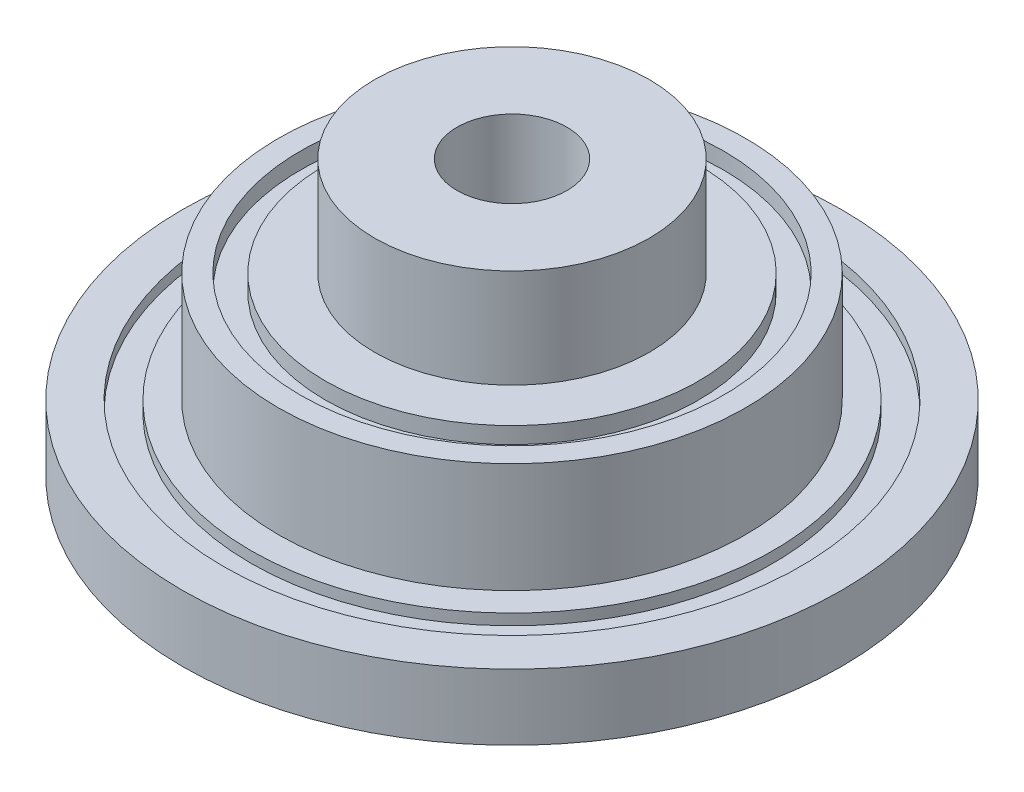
from build123d import *

# Parameters (mm, degrees)
SKETCH1_R          = 60
EXTRUDE1_DEPTH     = 12
SKETCH2_R          = 52.5
SKETCH2_R_2        = 47.5
CUT_EXTRUDE1_DEPTH = 2
SKETCH3_R          = 42.5
EXTRUDE2_DEPTH     = 20
SKETCH4_R          = 38.5
SKETCH4_R_2        = 34
CUT_EXTRUDE2_DEPTH = 3
SKETCH5_R          = 25
EXTRUDE3_DEPTH     = 18
SKETCH10_R         = 10
CUT_EXTRUDE7_DEPTH = 38


with BuildPart() as part:
    # Sketch1 → Extrude1 (new body)
    with BuildSketch(Plane(origin=(0, 0, 0), x_dir=(1, 0, 0), z_dir=(0, 1, 0))):
        with Locations(Location((0, 0, 0), (0, 0, 270))):
            Circle(SKETCH1_R)
    extrude(amount=EXTRUDE1_DEPTH)

    # Sketch2 → Cut-Extrude1 (cut)
    with BuildSketch(Plane(origin=(0, 12, 0), x_dir=(-1, 0, 0), z_dir=(0, 1, 0))):
        with Locations(Location((0, 0, 0), (0, 0, 90))):
            Circle(SKETCH2_R)
        with Locations(Location((0, 0, 0), (0, 0, 90))):
            Circle(SKETCH2_R_2, mode=Mode.SUBTRACT)
    extrude(amount=-CUT_EXTRUDE1_DEPTH, mode=Mode.SUBTRACT)

    # Sketch3 → Extrude2 (add)
    with BuildSketch(Plane(origin=(0, 12, 0), x_dir=(-1, 0, 0), z_dir=(0, 1, 0))):
        with Locations(Location((0, 0, 0), (0, 0, 90))):
            Circle(SKETCH3_R)
    extrude(amount=EXTRUDE2_DEPTH)

    # Sketch4 → Cut-Extrude2 (cut)
    with BuildSketch(Plane(origin=(0, 32, 0), x_dir=(-1, 0, 0), z_dir=(0, 1, 0))):
        with Locations(Location((0, 0, 0), (0, 0, 90))):
            Circle(SKETCH4_R)
        with Locations(Location((0, 0, 0), (0, 0, 90))):
            Circle(SKETCH4_R_2, mode=Mode.SUBTRACT)
    extrude(amount=-CUT_EXTRUDE2_DEPTH, mode=Mode.SUBTRACT)

    # Sketch5 → Extrude3 (add)
    with BuildSketch(Plane(origin=(0, 32, 0), x_dir=(-1, 0, 0), z_dir=(0, 1, 0))):
        with Locations(Location((0, 0, 0), (0, 0, 90))):
            Circle(SKETCH5_R)
    extrude(amount=EXTRUDE3_DEPTH)

    # Sketch10 → Cut-Extrude7 (cut)
    with BuildSketch(Plane(origin=(0, 50, 0), x_dir=(1, 0, 0), z_dir=(0, 1, 0))):
        with Locations(Location((0, 0, 0), (0, 0, 270))):
            Circle(SKETCH10_R)
    extrude(amount=-CUT_EXTRUDE7_DEPTH, mode=Mode.SUBTRACT)


solid = part.part
